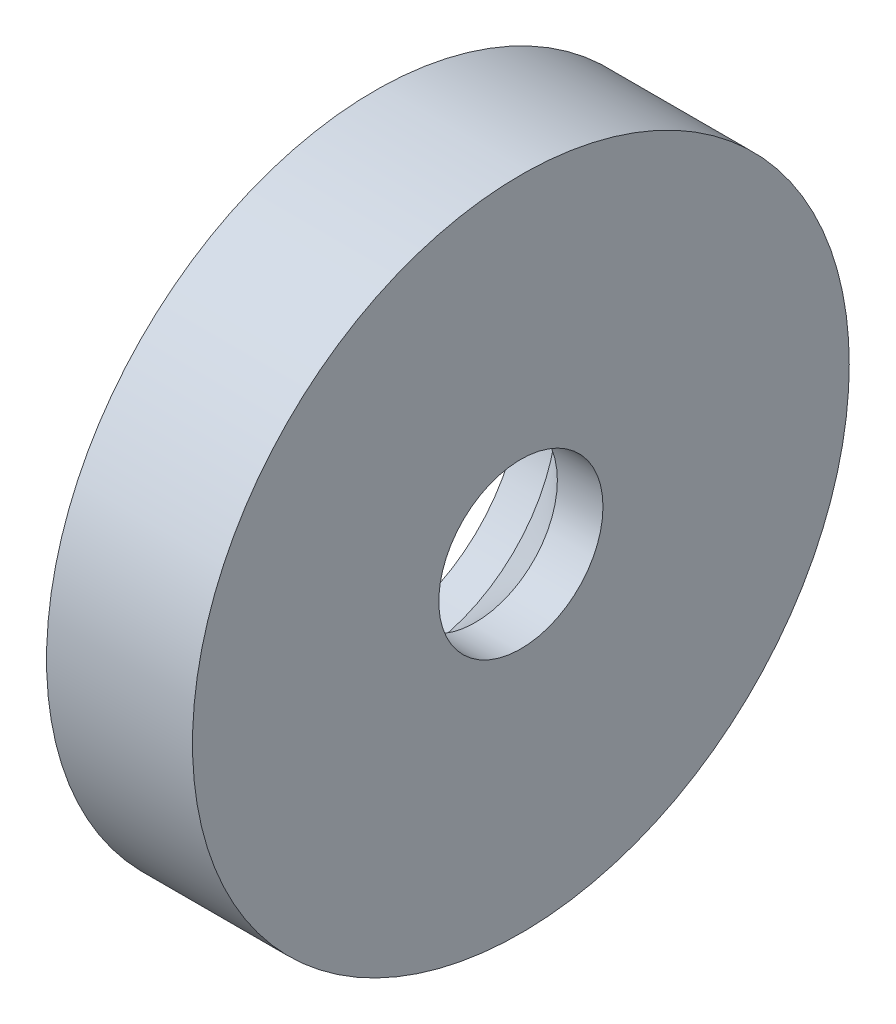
ISO-10303-21;
HEADER;
FILE_DESCRIPTION(('STEP AP214'),'2;1');
FILE_NAME('part.step','',(''),(''),'','','');
FILE_SCHEMA(('AUTOMOTIVE_DESIGN { 1 0 10303 214 1 1 1 1 }'));
ENDSEC;
DATA;
#1=APPLICATION_CONTEXT('core data for automotive mechanical design processes');
#2=APPLICATION_PROTOCOL_DEFINITION('international standard','automotive_design',2000,#1);
#3=PRODUCT_CONTEXT('',#1,'mechanical');
#4=PRODUCT('Part','Part','',(#3));
#5=PRODUCT_RELATED_PRODUCT_CATEGORY('part','',(#4));
#6=PRODUCT_DEFINITION_FORMATION('','',#4);
#7=PRODUCT_DEFINITION_CONTEXT('part definition',#1,'design');
#8=PRODUCT_DEFINITION('design','',#6,#7);
#9=PRODUCT_DEFINITION_SHAPE('','',#8);
#10=(LENGTH_UNIT() NAMED_UNIT(*) SI_UNIT(.MILLI.,.METRE.));
#11=(NAMED_UNIT(*) PLANE_ANGLE_UNIT() SI_UNIT($,.RADIAN.));
#12=(NAMED_UNIT(*) SI_UNIT($,.STERADIAN.) SOLID_ANGLE_UNIT());
#13=UNCERTAINTY_MEASURE_WITH_UNIT(LENGTH_MEASURE(1.E-05),#10,'distance_accuracy_value','');
#14=(GEOMETRIC_REPRESENTATION_CONTEXT(3) GLOBAL_UNCERTAINTY_ASSIGNED_CONTEXT((#13)) GLOBAL_UNIT_ASSIGNED_CONTEXT((#10,
#11,#12)) REPRESENTATION_CONTEXT('',''));
#15=CARTESIAN_POINT('',(0.,0.,0.));
#16=DIRECTION('',(0.,0.,1.));
#17=DIRECTION('',(1.,0.,0.));
#18=AXIS2_PLACEMENT_3D('',#15,#16,#17);
#19=CARTESIAN_POINT('',(0.5,0.,0.));
#20=DIRECTION('',(1.,0.,0.));
#21=DIRECTION('',(0.,0.,-1.));
#22=AXIS2_PLACEMENT_3D('',#19,#20,#21);
#23=CYLINDRICAL_SURFACE('',#22,4.);
#24=CARTESIAN_POINT('',(0.999999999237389,0.,0.));
#25=DIRECTION('',(-1.,0.,0.));
#26=DIRECTION('',(0.,1.,0.));
#27=AXIS2_PLACEMENT_3D('',#24,#25,#26);
#28=CIRCLE('',#27,3.99999999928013);
#29=CARTESIAN_POINT('',(0.999999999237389,3.99999999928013,0.));
#30=VERTEX_POINT('',#29);
#31=EDGE_CURVE('E34',#30,#30,#28,.F.);
#32=ORIENTED_EDGE('',*,*,#31,.T.);
#33=EDGE_LOOP('',(#32));
#34=FACE_BOUND('',#33,.T.);
#35=CARTESIAN_POINT('',(0.,0.,0.));
#36=DIRECTION('',(1.,0.,0.));
#37=DIRECTION('',(0.,0.,-1.));
#38=AXIS2_PLACEMENT_3D('',#35,#36,#37);
#39=CIRCLE('',#38,4.);
#40=CARTESIAN_POINT('',(0.,0.,-4.));
#41=VERTEX_POINT('',#40);
#42=EDGE_CURVE('E18',#41,#41,#39,.T.);
#43=ORIENTED_EDGE('',*,*,#42,.F.);
#44=EDGE_LOOP('',(#43));
#45=FACE_BOUND('',#44,.T.);
#46=ADVANCED_FACE('F15',(#34,#45),#23,.F.);
#47=CARTESIAN_POINT('',(0.,6.5,0.));
#48=DIRECTION('',(-1.,0.,0.));
#49=DIRECTION('',(0.,0.,1.));
#50=AXIS2_PLACEMENT_3D('',#47,#48,#49);
#51=PLANE('',#50);
#52=ORIENTED_EDGE('',*,*,#42,.T.);
#53=EDGE_LOOP('',(#52));
#54=FACE_BOUND('',#53,.T.);
#55=CARTESIAN_POINT('',(0.,0.,0.));
#56=DIRECTION('',(1.,0.,0.));
#57=DIRECTION('',(0.,0.,-1.));
#58=AXIS2_PLACEMENT_3D('',#55,#56,#57);
#59=CIRCLE('',#58,9.);
#60=CARTESIAN_POINT('',(0.,0.,-9.));
#61=VERTEX_POINT('',#60);
#62=EDGE_CURVE('E32',#61,#61,#59,.T.);
#63=ORIENTED_EDGE('',*,*,#62,.F.);
#64=EDGE_LOOP('',(#63));
#65=FACE_BOUND('',#64,.T.);
#66=ADVANCED_FACE('F47',(#54,#65),#51,.T.);
#67=CARTESIAN_POINT('',(0.999999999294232,0.,0.));
#68=DIRECTION('',(-1.,0.,0.));
#69=DIRECTION('',(0.,0.,1.));
#70=AXIS2_PLACEMENT_3D('',#67,#68,#69);
#71=CONICAL_SURFACE('',#70,3.99999999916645,0.785398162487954);
#72=CARTESIAN_POINT('',(2.75,0.,0.));
#73=DIRECTION('',(1.,0.,0.));
#74=DIRECTION('',(0.,0.,-1.));
#75=AXIS2_PLACEMENT_3D('',#72,#73,#74);
#76=CIRCLE('',#75,2.25);
#77=CARTESIAN_POINT('',(2.75,0.,-2.25));
#78=VERTEX_POINT('',#77);
#79=EDGE_CURVE('E27',#78,#78,#76,.T.);
#80=ORIENTED_EDGE('',*,*,#79,.T.);
#81=EDGE_LOOP('',(#80));
#82=FACE_BOUND('',#81,.T.);
#83=ORIENTED_EDGE('',*,*,#31,.F.);
#84=EDGE_LOOP('',(#83));
#85=FACE_BOUND('',#84,.T.);
#86=ADVANCED_FACE('F55',(#82,#85),#71,.F.);
#87=CARTESIAN_POINT('',(2.,0.,0.));
#88=DIRECTION('',(1.,0.,0.));
#89=DIRECTION('',(0.,0.,-1.));
#90=AXIS2_PLACEMENT_3D('',#87,#88,#89);
#91=CYLINDRICAL_SURFACE('',#90,9.);
#92=ORIENTED_EDGE('',*,*,#62,.T.);
#93=EDGE_LOOP('',(#92));
#94=FACE_BOUND('',#93,.T.);
#95=CARTESIAN_POINT('',(4.,0.,0.));
#96=DIRECTION('',(1.,0.,0.));
#97=DIRECTION('',(0.,0.,-1.));
#98=AXIS2_PLACEMENT_3D('',#95,#96,#97);
#99=CIRCLE('',#98,9.);
#100=CARTESIAN_POINT('',(4.,0.,-9.));
#101=VERTEX_POINT('',#100);
#102=EDGE_CURVE('E22',#101,#101,#99,.T.);
#103=ORIENTED_EDGE('',*,*,#102,.F.);
#104=EDGE_LOOP('',(#103));
#105=FACE_BOUND('',#104,.T.);
#106=ADVANCED_FACE('F63',(#94,#105),#91,.T.);
#107=CARTESIAN_POINT('',(3.375,0.,0.));
#108=DIRECTION('',(1.,0.,0.));
#109=DIRECTION('',(0.,0.,-1.));
#110=AXIS2_PLACEMENT_3D('',#107,#108,#109);
#111=CYLINDRICAL_SURFACE('',#110,2.25);
#112=CARTESIAN_POINT('',(4.,0.,0.));
#113=DIRECTION('',(1.,0.,0.));
#114=DIRECTION('',(0.,0.,-1.));
#115=AXIS2_PLACEMENT_3D('',#112,#113,#114);
#116=CIRCLE('',#115,2.25);
#117=CARTESIAN_POINT('',(4.,0.,-2.25));
#118=VERTEX_POINT('',#117);
#119=EDGE_CURVE('E10',#118,#118,#116,.F.);
#120=ORIENTED_EDGE('',*,*,#119,.F.);
#121=EDGE_LOOP('',(#120));
#122=FACE_BOUND('',#121,.T.);
#123=ORIENTED_EDGE('',*,*,#79,.F.);
#124=EDGE_LOOP('',(#123));
#125=FACE_BOUND('',#124,.T.);
#126=ADVANCED_FACE('F58',(#122,#125),#111,.F.);
#127=CARTESIAN_POINT('',(4.,5.625,0.));
#128=DIRECTION('',(1.,0.,0.));
#129=DIRECTION('',(0.,0.,-1.));
#130=AXIS2_PLACEMENT_3D('',#127,#128,#129);
#131=PLANE('',#130);
#132=ORIENTED_EDGE('',*,*,#119,.T.);
#133=EDGE_LOOP('',(#132));
#134=FACE_BOUND('',#133,.T.);
#135=ORIENTED_EDGE('',*,*,#102,.T.);
#136=EDGE_LOOP('',(#135));
#137=FACE_BOUND('',#136,.T.);
#138=ADVANCED_FACE('F56',(#134,#137),#131,.T.);
#139=CLOSED_SHELL('',(#46,#66,#86,#106,#126,#138));
#140=MANIFOLD_SOLID_BREP('B1',#139);
#141=ADVANCED_BREP_SHAPE_REPRESENTATION('',(#18,#140),#14);
#142=SHAPE_DEFINITION_REPRESENTATION(#9,#141);
ENDSEC;
END-ISO-10303-21;
